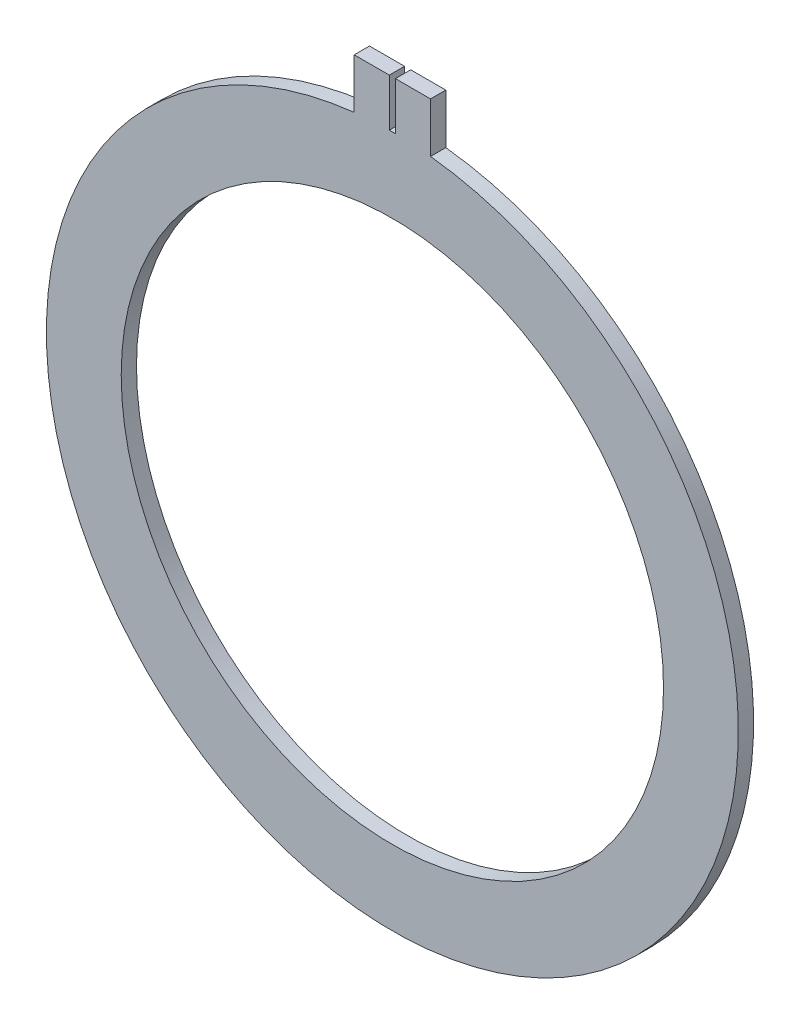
ISO-10303-21;
HEADER;
FILE_DESCRIPTION(('STEP AP214'),'2;1');
FILE_NAME('part.step','',(''),(''),'','','');
FILE_SCHEMA(('AUTOMOTIVE_DESIGN { 1 0 10303 214 1 1 1 1 }'));
ENDSEC;
DATA;
#1=APPLICATION_CONTEXT('core data for automotive mechanical design processes');
#2=APPLICATION_PROTOCOL_DEFINITION('international standard','automotive_design',2000,#1);
#3=PRODUCT_CONTEXT('',#1,'mechanical');
#4=PRODUCT('Part','Part','',(#3));
#5=PRODUCT_RELATED_PRODUCT_CATEGORY('part','',(#4));
#6=PRODUCT_DEFINITION_FORMATION('','',#4);
#7=PRODUCT_DEFINITION_CONTEXT('part definition',#1,'design');
#8=PRODUCT_DEFINITION('design','',#6,#7);
#9=PRODUCT_DEFINITION_SHAPE('','',#8);
#10=(LENGTH_UNIT() NAMED_UNIT(*) SI_UNIT(.MILLI.,.METRE.));
#11=(NAMED_UNIT(*) PLANE_ANGLE_UNIT() SI_UNIT($,.RADIAN.));
#12=(NAMED_UNIT(*) SI_UNIT($,.STERADIAN.) SOLID_ANGLE_UNIT());
#13=UNCERTAINTY_MEASURE_WITH_UNIT(LENGTH_MEASURE(1.E-05),#10,'distance_accuracy_value','');
#14=(GEOMETRIC_REPRESENTATION_CONTEXT(3) GLOBAL_UNCERTAINTY_ASSIGNED_CONTEXT((#13)) GLOBAL_UNIT_ASSIGNED_CONTEXT((#10,
#11,#12)) REPRESENTATION_CONTEXT('',''));
#15=CARTESIAN_POINT('',(0.,0.,0.));
#16=DIRECTION('',(0.,0.,1.));
#17=DIRECTION('',(1.,0.,0.));
#18=AXIS2_PLACEMENT_3D('',#15,#16,#17);
#19=CARTESIAN_POINT('',(-1.5875,16.373475,0.));
#20=DIRECTION('',(0.,1.,0.));
#21=DIRECTION('',(0.,0.,1.));
#22=AXIS2_PLACEMENT_3D('',#19,#20,#21);
#23=PLANE('',#22);
#24=DIRECTION('',(0.,0.,1.));
#25=VECTOR('',#24,1.);
#26=CARTESIAN_POINT('',(-0.127,16.373475,0.));
#27=LINE('',#26,#25);
#28=CARTESIAN_POINT('',(-0.127,16.373475,0.));
#29=VERTEX_POINT('',#28);
#30=CARTESIAN_POINT('',(-0.127,16.373475,0.635));
#31=VERTEX_POINT('',#30);
#32=EDGE_CURVE('E41',#29,#31,#27,.T.);
#33=ORIENTED_EDGE('',*,*,#32,.F.);
#34=DIRECTION('',(-1.,0.,0.));
#35=VECTOR('',#34,1.);
#36=CARTESIAN_POINT('',(-1.5875,16.373475,0.));
#37=LINE('',#36,#35);
#38=CARTESIAN_POINT('',(-1.5875,16.373475,0.));
#39=VERTEX_POINT('',#38);
#40=EDGE_CURVE('E137',#29,#39,#37,.T.);
#41=ORIENTED_EDGE('',*,*,#40,.T.);
#42=DIRECTION('',(0.,0.,1.));
#43=VECTOR('',#42,1.);
#44=CARTESIAN_POINT('',(-1.5875,16.373475,0.));
#45=LINE('',#44,#43);
#46=CARTESIAN_POINT('',(-1.5875,16.373475,0.635));
#47=VERTEX_POINT('',#46);
#48=EDGE_CURVE('E142',#39,#47,#45,.T.);
#49=ORIENTED_EDGE('',*,*,#48,.T.);
#50=DIRECTION('',(-1.,0.,0.));
#51=VECTOR('',#50,1.);
#52=CARTESIAN_POINT('',(-1.5875,16.373475,0.635));
#53=LINE('',#52,#51);
#54=EDGE_CURVE('E130',#31,#47,#53,.T.);
#55=ORIENTED_EDGE('',*,*,#54,.F.);
#56=EDGE_LOOP('',(#33,#41,#49,#55));
#57=FACE_BOUND('',#56,.T.);
#58=ADVANCED_FACE('F33',(#57),#23,.T.);
#59=CARTESIAN_POINT('',(0.,0.,0.635));
#60=DIRECTION('',(0.,0.,1.));
#61=DIRECTION('',(1.,0.,0.));
#62=AXIS2_PLACEMENT_3D('',#59,#60,#61);
#63=PLANE('',#62);
#64=DIRECTION('',(0.,-1.,0.));
#65=VECTOR('',#64,1.);
#66=CARTESIAN_POINT('',(-0.127,16.373475,0.635));
#67=LINE('',#66,#65);
#68=CARTESIAN_POINT('',(-0.127,14.3891,0.635));
#69=VERTEX_POINT('',#68);
#70=EDGE_CURVE('E110',#31,#69,#67,.T.);
#71=ORIENTED_EDGE('',*,*,#70,.F.);
#72=ORIENTED_EDGE('',*,*,#54,.T.);
#73=DIRECTION('',(0.,-1.,0.));
#74=VECTOR('',#73,1.);
#75=CARTESIAN_POINT('',(-1.5875,16.373475,0.635));
#76=LINE('',#75,#74);
#77=CARTESIAN_POINT('',(-1.5875,14.3012601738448,0.635));
#78=VERTEX_POINT('',#77);
#79=EDGE_CURVE('E56',#47,#78,#76,.T.);
#80=ORIENTED_EDGE('',*,*,#79,.T.);
#81=CARTESIAN_POINT('',(0.,0.,0.635));
#82=DIRECTION('',(0.,0.,1.));
#83=DIRECTION('',(1.,0.,0.));
#84=AXIS2_PLACEMENT_3D('',#81,#82,#83);
#85=CIRCLE('',#84,14.3891);
#86=CARTESIAN_POINT('',(1.5875,14.3012601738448,0.635));
#87=VERTEX_POINT('',#86);
#88=EDGE_CURVE('E156',#78,#87,#85,.T.);
#89=ORIENTED_EDGE('',*,*,#88,.T.);
#90=DIRECTION('',(0.,1.,0.));
#91=VECTOR('',#90,1.);
#92=CARTESIAN_POINT('',(1.5875,16.373475,0.635));
#93=LINE('',#92,#91);
#94=CARTESIAN_POINT('',(1.5875,16.373475,0.635));
#95=VERTEX_POINT('',#94);
#96=EDGE_CURVE('E128',#87,#95,#93,.T.);
#97=ORIENTED_EDGE('',*,*,#96,.T.);
#98=CARTESIAN_POINT('',(0.127,16.373475,0.635));
#99=VERTEX_POINT('',#98);
#100=EDGE_CURVE('E131',#95,#99,#53,.T.);
#101=ORIENTED_EDGE('',*,*,#100,.T.);
#102=DIRECTION('',(0.,1.,0.));
#103=VECTOR('',#102,1.);
#104=CARTESIAN_POINT('',(0.127,16.373475,0.635));
#105=LINE('',#104,#103);
#106=CARTESIAN_POINT('',(0.127,14.3891,0.635));
#107=VERTEX_POINT('',#106);
#108=EDGE_CURVE('E48',#107,#99,#105,.T.);
#109=ORIENTED_EDGE('',*,*,#108,.F.);
#110=DIRECTION('',(1.,0.,0.));
#111=VECTOR('',#110,1.);
#112=CARTESIAN_POINT('',(-0.127,14.3891,0.635));
#113=LINE('',#112,#111);
#114=EDGE_CURVE('E104',#69,#107,#113,.T.);
#115=ORIENTED_EDGE('',*,*,#114,.F.);
#116=EDGE_LOOP('',(#71,#72,#80,#89,#97,#101,#109,#115));
#117=FACE_BOUND('',#116,.T.);
#118=CARTESIAN_POINT('',(0.,0.,0.635));
#119=DIRECTION('',(0.,0.,1.));
#120=DIRECTION('',(1.,0.,0.));
#121=AXIS2_PLACEMENT_3D('',#118,#119,#120);
#122=CIRCLE('',#121,11.2776);
#123=CARTESIAN_POINT('',(11.2776,0.,0.635));
#124=VERTEX_POINT('',#123);
#125=EDGE_CURVE('E150',#124,#124,#122,.T.);
#126=ORIENTED_EDGE('',*,*,#125,.F.);
#127=EDGE_LOOP('',(#126));
#128=FACE_BOUND('',#127,.T.);
#129=ADVANCED_FACE('F115',(#117,#128),#63,.T.);
#130=CARTESIAN_POINT('',(0.,0.,0.));
#131=DIRECTION('',(0.,0.,1.));
#132=DIRECTION('',(1.,0.,0.));
#133=AXIS2_PLACEMENT_3D('',#130,#131,#132);
#134=PLANE('',#133);
#135=ORIENTED_EDGE('',*,*,#40,.F.);
#136=DIRECTION('',(0.,-1.,0.));
#137=VECTOR('',#136,1.);
#138=CARTESIAN_POINT('',(-0.126999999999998,0.,0.));
#139=LINE('',#138,#137);
#140=CARTESIAN_POINT('',(-0.127,14.3891,0.));
#141=VERTEX_POINT('',#140);
#142=EDGE_CURVE('E125',#29,#141,#139,.T.);
#143=ORIENTED_EDGE('',*,*,#142,.T.);
#144=DIRECTION('',(1.,0.,0.));
#145=VECTOR('',#144,1.);
#146=CARTESIAN_POINT('',(0.,14.3891,0.));
#147=LINE('',#146,#145);
#148=CARTESIAN_POINT('',(0.127,14.3891,0.));
#149=VERTEX_POINT('',#148);
#150=EDGE_CURVE('E11',#141,#149,#147,.T.);
#151=ORIENTED_EDGE('',*,*,#150,.T.);
#152=DIRECTION('',(0.,1.,0.));
#153=VECTOR('',#152,1.);
#154=CARTESIAN_POINT('',(0.126999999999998,0.,0.));
#155=LINE('',#154,#153);
#156=CARTESIAN_POINT('',(0.127,16.373475,0.));
#157=VERTEX_POINT('',#156);
#158=EDGE_CURVE('E121',#149,#157,#155,.T.);
#159=ORIENTED_EDGE('',*,*,#158,.T.);
#160=CARTESIAN_POINT('',(1.5875,16.373475,0.));
#161=VERTEX_POINT('',#160);
#162=EDGE_CURVE('E138',#161,#157,#37,.T.);
#163=ORIENTED_EDGE('',*,*,#162,.F.);
#164=DIRECTION('',(0.,1.,0.));
#165=VECTOR('',#164,1.);
#166=CARTESIAN_POINT('',(1.5875,16.373475,0.));
#167=LINE('',#166,#165);
#168=CARTESIAN_POINT('',(1.5875,14.3012601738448,0.));
#169=VERTEX_POINT('',#168);
#170=EDGE_CURVE('E135',#169,#161,#167,.T.);
#171=ORIENTED_EDGE('',*,*,#170,.F.);
#172=CARTESIAN_POINT('',(0.,0.,0.));
#173=DIRECTION('',(0.,0.,1.));
#174=DIRECTION('',(1.,0.,0.));
#175=AXIS2_PLACEMENT_3D('',#172,#173,#174);
#176=CIRCLE('',#175,14.3891);
#177=CARTESIAN_POINT('',(-1.5875,14.3012601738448,0.));
#178=VERTEX_POINT('',#177);
#179=EDGE_CURVE('E153',#178,#169,#176,.T.);
#180=ORIENTED_EDGE('',*,*,#179,.F.);
#181=DIRECTION('',(0.,-1.,0.));
#182=VECTOR('',#181,1.);
#183=CARTESIAN_POINT('',(-1.5875,16.373475,0.));
#184=LINE('',#183,#182);
#185=EDGE_CURVE('E133',#39,#178,#184,.T.);
#186=ORIENTED_EDGE('',*,*,#185,.F.);
#187=EDGE_LOOP('',(#135,#143,#151,#159,#163,#171,#180,#186));
#188=FACE_BOUND('',#187,.T.);
#189=CARTESIAN_POINT('',(0.,0.,0.));
#190=DIRECTION('',(0.,0.,1.));
#191=DIRECTION('',(1.,0.,0.));
#192=AXIS2_PLACEMENT_3D('',#189,#190,#191);
#193=CIRCLE('',#192,11.2776);
#194=CARTESIAN_POINT('',(11.2776,0.,0.));
#195=VERTEX_POINT('',#194);
#196=EDGE_CURVE('E145',#195,#195,#193,.T.);
#197=ORIENTED_EDGE('',*,*,#196,.T.);
#198=EDGE_LOOP('',(#197));
#199=FACE_BOUND('',#198,.T.);
#200=ADVANCED_FACE('F171',(#188,#199),#134,.F.);
#201=CARTESIAN_POINT('',(0.,0.,0.635));
#202=DIRECTION('',(0.,0.,-1.));
#203=DIRECTION('',(-1.,0.,0.));
#204=AXIS2_PLACEMENT_3D('',#201,#202,#203);
#205=CYLINDRICAL_SURFACE('',#204,14.3891);
#206=ORIENTED_EDGE('',*,*,#88,.F.);
#207=DIRECTION('',(0.,0.,-1.));
#208=VECTOR('',#207,1.);
#209=CARTESIAN_POINT('',(-1.5875,14.3012601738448,0.635));
#210=LINE('',#209,#208);
#211=EDGE_CURVE('E161',#78,#178,#210,.T.);
#212=ORIENTED_EDGE('',*,*,#211,.T.);
#213=ORIENTED_EDGE('',*,*,#179,.T.);
#214=DIRECTION('',(0.,0.,-1.));
#215=VECTOR('',#214,1.);
#216=CARTESIAN_POINT('',(1.5875,14.3012601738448,0.635));
#217=LINE('',#216,#215);
#218=EDGE_CURVE('E158',#169,#87,#217,.F.);
#219=ORIENTED_EDGE('',*,*,#218,.T.);
#220=EDGE_LOOP('',(#206,#212,#213,#219));
#221=FACE_BOUND('',#220,.T.);
#222=ADVANCED_FACE('F35',(#221),#205,.T.);
#223=CARTESIAN_POINT('',(0.,0.,0.635));
#224=DIRECTION('',(0.,0.,-1.));
#225=DIRECTION('',(-1.,0.,0.));
#226=AXIS2_PLACEMENT_3D('',#223,#224,#225);
#227=CYLINDRICAL_SURFACE('',#226,11.2776);
#228=ORIENTED_EDGE('',*,*,#196,.F.);
#229=EDGE_LOOP('',(#228));
#230=FACE_BOUND('',#229,.T.);
#231=ORIENTED_EDGE('',*,*,#125,.T.);
#232=EDGE_LOOP('',(#231));
#233=FACE_BOUND('',#232,.T.);
#234=ADVANCED_FACE('F202',(#230,#233),#227,.F.);
#235=CARTESIAN_POINT('',(-1.5875,16.373475,0.));
#236=DIRECTION('',(-1.,0.,0.));
#237=DIRECTION('',(0.,0.,1.));
#238=AXIS2_PLACEMENT_3D('',#235,#236,#237);
#239=PLANE('',#238);
#240=ORIENTED_EDGE('',*,*,#211,.F.);
#241=ORIENTED_EDGE('',*,*,#79,.F.);
#242=ORIENTED_EDGE('',*,*,#48,.F.);
#243=ORIENTED_EDGE('',*,*,#185,.T.);
#244=EDGE_LOOP('',(#240,#241,#242,#243));
#245=FACE_BOUND('',#244,.T.);
#246=ADVANCED_FACE('F183',(#245),#239,.T.);
#247=CARTESIAN_POINT('',(1.5875,16.373475,0.));
#248=DIRECTION('',(1.,0.,0.));
#249=DIRECTION('',(0.,0.,-1.));
#250=AXIS2_PLACEMENT_3D('',#247,#248,#249);
#251=PLANE('',#250);
#252=ORIENTED_EDGE('',*,*,#218,.F.);
#253=ORIENTED_EDGE('',*,*,#170,.T.);
#254=DIRECTION('',(0.,0.,1.));
#255=VECTOR('',#254,1.);
#256=CARTESIAN_POINT('',(1.5875,16.373475,0.));
#257=LINE('',#256,#255);
#258=EDGE_CURVE('E141',#161,#95,#257,.T.);
#259=ORIENTED_EDGE('',*,*,#258,.T.);
#260=ORIENTED_EDGE('',*,*,#96,.F.);
#261=EDGE_LOOP('',(#252,#253,#259,#260));
#262=FACE_BOUND('',#261,.T.);
#263=ADVANCED_FACE('F177',(#262),#251,.T.);
#264=DIRECTION('',(0.,0.,-1.));
#265=VECTOR('',#264,1.);
#266=CARTESIAN_POINT('',(0.127,16.373475,0.));
#267=LINE('',#266,#265);
#268=EDGE_CURVE('E164',#99,#157,#267,.T.);
#269=ORIENTED_EDGE('',*,*,#268,.F.);
#270=ORIENTED_EDGE('',*,*,#100,.F.);
#271=ORIENTED_EDGE('',*,*,#258,.F.);
#272=ORIENTED_EDGE('',*,*,#162,.T.);
#273=EDGE_LOOP('',(#269,#270,#271,#272));
#274=FACE_BOUND('',#273,.T.);
#275=ADVANCED_FACE('F175',(#274),#23,.T.);
#276=CARTESIAN_POINT('',(-0.127,14.3891,-1.349375));
#277=DIRECTION('',(0.,-1.,0.));
#278=DIRECTION('',(0.,0.,-1.));
#279=AXIS2_PLACEMENT_3D('',#276,#277,#278);
#280=PLANE('',#279);
#281=DIRECTION('',(0.,0.,1.));
#282=VECTOR('',#281,1.);
#283=CARTESIAN_POINT('',(-0.127,14.3891,-1.349375));
#284=LINE('',#283,#282);
#285=EDGE_CURVE('E99',#141,#69,#284,.T.);
#286=ORIENTED_EDGE('',*,*,#285,.T.);
#287=ORIENTED_EDGE('',*,*,#114,.T.);
#288=DIRECTION('',(0.,0.,1.));
#289=VECTOR('',#288,1.);
#290=CARTESIAN_POINT('',(0.127,14.3891,-1.349375));
#291=LINE('',#290,#289);
#292=EDGE_CURVE('E107',#149,#107,#291,.T.);
#293=ORIENTED_EDGE('',*,*,#292,.F.);
#294=ORIENTED_EDGE('',*,*,#150,.F.);
#295=EDGE_LOOP('',(#286,#287,#293,#294));
#296=FACE_BOUND('',#295,.T.);
#297=ADVANCED_FACE('F101',(#296),#280,.F.);
#298=CARTESIAN_POINT('',(-0.127,16.373475,-1.349375));
#299=DIRECTION('',(-1.,0.,0.));
#300=DIRECTION('',(0.,-1.,0.));
#301=AXIS2_PLACEMENT_3D('',#298,#299,#300);
#302=PLANE('',#301);
#303=ORIENTED_EDGE('',*,*,#32,.T.);
#304=ORIENTED_EDGE('',*,*,#70,.T.);
#305=ORIENTED_EDGE('',*,*,#285,.F.);
#306=ORIENTED_EDGE('',*,*,#142,.F.);
#307=EDGE_LOOP('',(#303,#304,#305,#306));
#308=FACE_BOUND('',#307,.T.);
#309=ADVANCED_FACE('F111',(#308),#302,.F.);
#310=CARTESIAN_POINT('',(0.127,16.373475,-1.349375));
#311=DIRECTION('',(1.,0.,0.));
#312=DIRECTION('',(0.,1.,0.));
#313=AXIS2_PLACEMENT_3D('',#310,#311,#312);
#314=PLANE('',#313);
#315=ORIENTED_EDGE('',*,*,#292,.T.);
#316=ORIENTED_EDGE('',*,*,#108,.T.);
#317=ORIENTED_EDGE('',*,*,#268,.T.);
#318=ORIENTED_EDGE('',*,*,#158,.F.);
#319=EDGE_LOOP('',(#315,#316,#317,#318));
#320=FACE_BOUND('',#319,.T.);
#321=ADVANCED_FACE('F165',(#320),#314,.F.);
#322=CLOSED_SHELL('',(#58,#129,#200,#222,#234,#246,#263,#275,#297,#309,#321));
#323=MANIFOLD_SOLID_BREP('B2',#322);
#324=ADVANCED_BREP_SHAPE_REPRESENTATION('',(#18,#323),#14);
#325=SHAPE_DEFINITION_REPRESENTATION(#9,#324);
ENDSEC;
END-ISO-10303-21;
